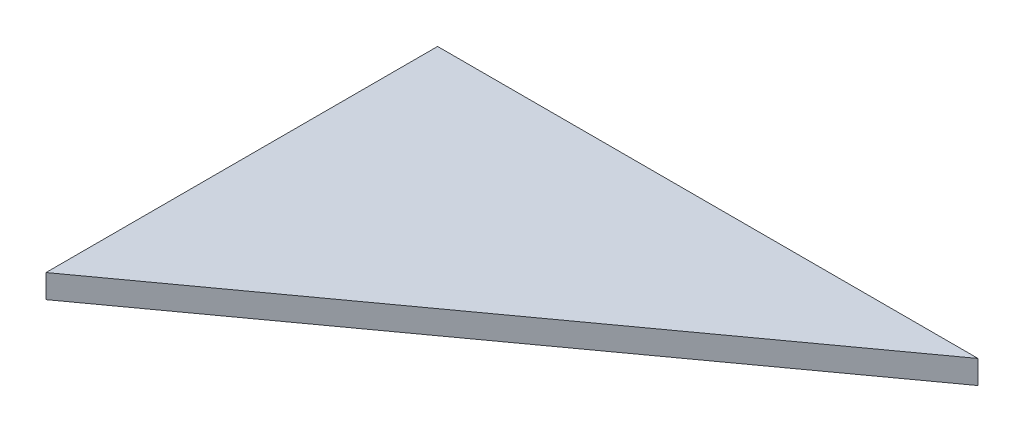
from build123d import *

# Parameters (mm, degrees)
EXTRUSION1_DEPTH = 3


with BuildPart() as part:
    # Esquisse1 → Extrusion1 (new body)
    with BuildSketch(Plane(origin=(0, 0, 0), x_dir=(1, 0, 0), z_dir=(0, 1, 0))):
        Polygon((0, 0), (0, -50), (69, 0), align=None)
    extrude(amount=EXTRUSION1_DEPTH)


solid = part.part
